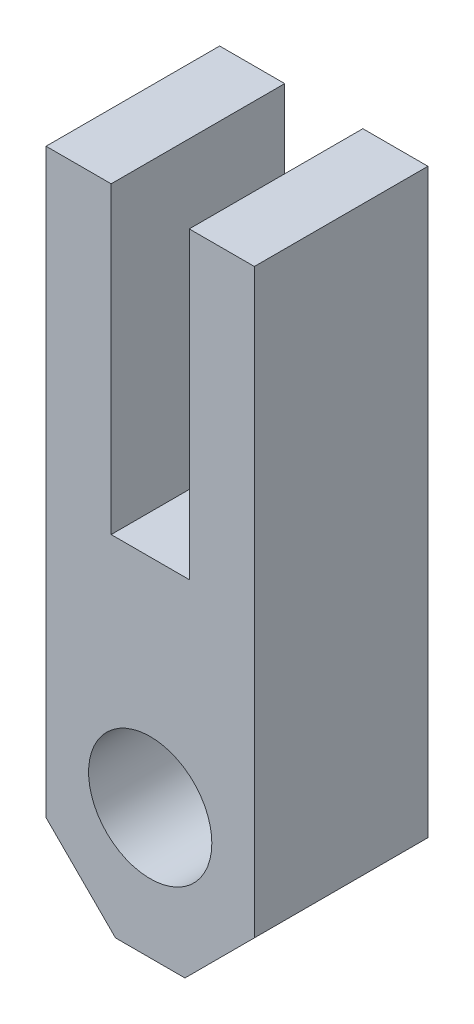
from build123d import *

# Parameters (mm, degrees)
ESQUISSE1_R      = 7.1
EXTRUSION1_DEPTH = 20


with BuildPart() as part:
    # Esquisse1 → Extrusion1 (new body)
    with BuildSketch(Plane.XY):
        Polygon((4.5, 25), (-4.5, 25), (-4.5, 60), (-12, 60), (-12, -7), (-4, -15), (4, -15), (12, -7), (12, 60), (4.5, 60), align=None)
        Circle(ESQUISSE1_R, mode=Mode.SUBTRACT)
    extrude(amount=EXTRUSION1_DEPTH)


solid = part.part
